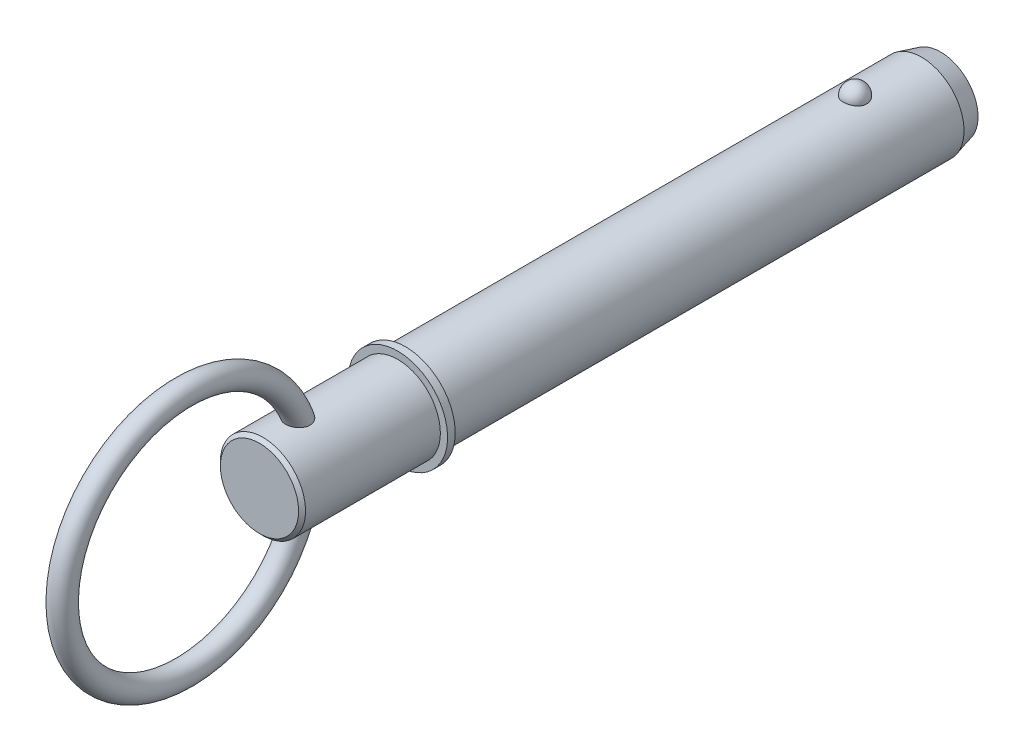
from build123d import *

# Parameters (mm, degrees)
SKETCH2_R           = 11.115
BOSS_EXTRUDE1_DEPTH = 114.3
BOSS_EXTRUDE2_START = 25.4
SKETCH3_R           = 11.115
BOSS_EXTRUDE2_DEPTH = 25.4
CHAMFER1_SIZE       = 5
CHAMFER1_SIZE2      = 1.339745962
SKETCH20_W          = 2
SKETCH20_H          = 13
SKETCH21_R          = 11.115
BOSS_EXTRUDE3_DEPTH = 38.1
CHAMFER2_SIZE       = 0.9
SKETCH24_R          = 3


with BuildPart() as part:
    # Sketch2 → Boss-Extrude1 (new body)
    with BuildSketch(Plane.XY):
        Circle(SKETCH2_R)
    extrude(amount=BOSS_EXTRUDE1_DEPTH)

    # Sketch3 → Boss-Extrude2 (add)
    with BuildSketch(Plane(origin=(0, 0, 0), x_dir=(-1, 0, 0), z_dir=(0, 0, -1)).offset(BOSS_EXTRUDE2_START)):
        Circle(SKETCH3_R)
    extrude(amount=-BOSS_EXTRUDE2_DEPTH)

    # Chamfer1
    chamfer1_edges = [part.edges().sort_by_distance(p)[0] for p in [
        (11.115, 0, -25.4),
    ]]
    chamfer1_side = [part.faces().sort_by_distance(p)[0] for p in [
        (11.115, 0, -12.7),
    ]]
    chamfer(chamfer1_edges, length=CHAMFER1_SIZE, length2=CHAMFER1_SIZE2, reference=chamfer1_side[0])

    # Sketch18 → Revolve1 (revolve)
    with BuildSketch(Plane(origin=(0, 0, 0), x_dir=(0, 0, -1), z_dir=(1, 0, 0))):
        with BuildLine():
            Line((3.07, 14.185), (3.07, 8.045))
            ThreePointArc((3.07, 8.045), (0, 11.115), (3.07, 14.185))
        make_face()
    revolve(axis=Axis((0, 14.185, -3.07), (0, -1, 0)))

    # Sketch20 → Revolve2 (revolve)
    with BuildSketch(Plane(origin=(0, 0, 0), x_dir=(0, 0, -1), z_dir=(1, 0, 0)), mode=Mode.PRIVATE) as revolve2_sk:
        with Locations((-115.3, 6.5)):
            Rectangle(SKETCH20_W, SKETCH20_H)
    revolve(revolve2_sk.sketch.rotate(Axis((0, 0, 33.728787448), (0, 0, 1)), 90), axis=Axis((0, 0, 33.728787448), (0, 0, 1)))

    # Sketch21 → Boss-Extrude3 (add)
    with BuildSketch(Plane(origin=(0, 0, 114.3), x_dir=(-1, 0, 0), z_dir=(0, 0, -1))):
        Circle(SKETCH21_R)
    extrude(amount=-BOSS_EXTRUDE3_DEPTH)

    # Chamfer2
    chamfer2_edges = [part.edges().sort_by_distance(p)[0] for p in [
        (11.115, 0, 152.4),
    ]]
    chamfer(chamfer2_edges, length=CHAMFER2_SIZE)

    # Sweep1: sweep along a path in Sketch23
    with BuildLine(Plane(origin=(0, 0, 0), x_dir=(0, 0, -1), z_dir=(1, 0, 0))) as sweep1_path:
        CenterArc((-172.15, 0), 31.75, 0, 360)
    # Sketch24 → Sweep1 (sweep)
    with BuildSketch(Plane(origin=(0, 0, 0), x_dir=(1, 0, 0), z_dir=(0, 1, 0))):
        with Locations((0, -140.4)):
            Circle(SKETCH24_R)
    sweep(path=sweep1_path.line)


solid = part.part
